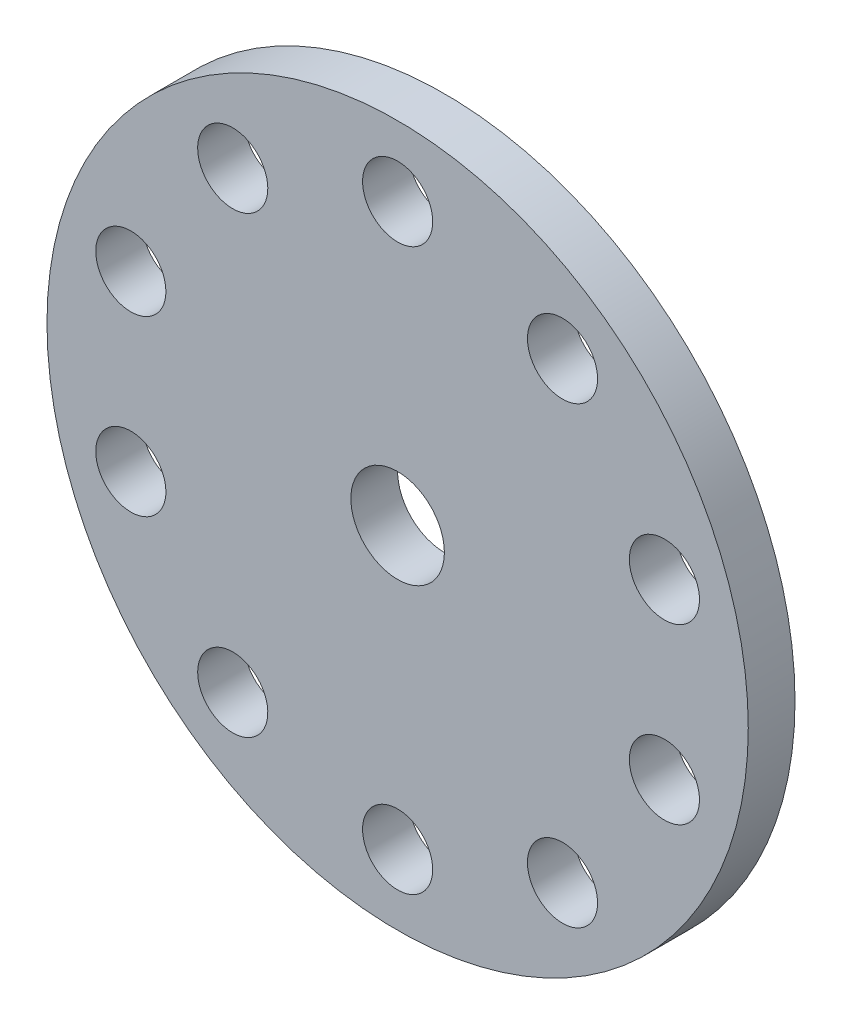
ISO-10303-21;
HEADER;
FILE_DESCRIPTION(('STEP AP214'),'2;1');
FILE_NAME('part.step','',(''),(''),'','','');
FILE_SCHEMA(('AUTOMOTIVE_DESIGN { 1 0 10303 214 1 1 1 1 }'));
ENDSEC;
DATA;
#1=APPLICATION_CONTEXT('core data for automotive mechanical design processes');
#2=APPLICATION_PROTOCOL_DEFINITION('international standard','automotive_design',2000,#1);
#3=PRODUCT_CONTEXT('',#1,'mechanical');
#4=PRODUCT('Part','Part','',(#3));
#5=PRODUCT_RELATED_PRODUCT_CATEGORY('part','',(#4));
#6=PRODUCT_DEFINITION_FORMATION('','',#4);
#7=PRODUCT_DEFINITION_CONTEXT('part definition',#1,'design');
#8=PRODUCT_DEFINITION('design','',#6,#7);
#9=PRODUCT_DEFINITION_SHAPE('','',#8);
#10=(LENGTH_UNIT() NAMED_UNIT(*) SI_UNIT(.MILLI.,.METRE.));
#11=(NAMED_UNIT(*) PLANE_ANGLE_UNIT() SI_UNIT($,.RADIAN.));
#12=(NAMED_UNIT(*) SI_UNIT($,.STERADIAN.) SOLID_ANGLE_UNIT());
#13=UNCERTAINTY_MEASURE_WITH_UNIT(LENGTH_MEASURE(1.E-05),#10,'distance_accuracy_value','');
#14=(GEOMETRIC_REPRESENTATION_CONTEXT(3) GLOBAL_UNCERTAINTY_ASSIGNED_CONTEXT((#13)) GLOBAL_UNIT_ASSIGNED_CONTEXT((#10,
#11,#12)) REPRESENTATION_CONTEXT('',''));
#15=CARTESIAN_POINT('',(0.,0.,0.));
#16=DIRECTION('',(0.,0.,1.));
#17=DIRECTION('',(1.,0.,0.));
#18=AXIS2_PLACEMENT_3D('',#15,#16,#17);
#19=CARTESIAN_POINT('',(0.,0.,20.));
#20=DIRECTION('',(0.,0.,1.));
#21=DIRECTION('',(1.,0.,0.));
#22=AXIS2_PLACEMENT_3D('',#19,#20,#21);
#23=PLANE('',#22);
#24=CARTESIAN_POINT('',(70.5342302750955,97.0820393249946,20.));
#25=DIRECTION('',(0.,0.,1.));
#26=DIRECTION('',(0.809016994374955,-0.587785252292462,0.));
#27=AXIS2_PLACEMENT_3D('',#24,#25,#26);
#28=CIRCLE('',#27,15.);
#29=CARTESIAN_POINT('',(82.6694851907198,88.2652605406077,20.));
#30=VERTEX_POINT('',#29);
#31=EDGE_CURVE('E61',#30,#30,#28,.T.);
#32=ORIENTED_EDGE('',*,*,#31,.F.);
#33=EDGE_LOOP('',(#32));
#34=FACE_BOUND('',#33,.T.);
#35=CARTESIAN_POINT('',(114.126781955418,37.082039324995,20.));
#36=DIRECTION('',(0.,0.,1.));
#37=DIRECTION('',(0.309016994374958,-0.95105651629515,0.));
#38=AXIS2_PLACEMENT_3D('',#35,#36,#37);
#39=CIRCLE('',#38,15.);
#40=CARTESIAN_POINT('',(118.762036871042,22.8161915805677,20.));
#41=VERTEX_POINT('',#40);
#42=EDGE_CURVE('E67',#41,#41,#39,.T.);
#43=ORIENTED_EDGE('',*,*,#42,.F.);
#44=EDGE_LOOP('',(#43));
#45=FACE_BOUND('',#44,.T.);
#46=CARTESIAN_POINT('',(114.126781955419,-37.0820393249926,20.));
#47=DIRECTION('',(0.,0.,1.));
#48=DIRECTION('',(-0.309016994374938,-0.951056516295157,0.));
#49=AXIS2_PLACEMENT_3D('',#46,#47,#48);
#50=CIRCLE('',#49,15.);
#51=CARTESIAN_POINT('',(109.491527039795,-51.3478870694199,20.));
#52=VERTEX_POINT('',#51);
#53=EDGE_CURVE('E73',#52,#52,#50,.T.);
#54=ORIENTED_EDGE('',*,*,#53,.F.);
#55=EDGE_LOOP('',(#54));
#56=FACE_BOUND('',#55,.T.);
#57=CARTESIAN_POINT('',(70.5342302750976,-97.0820393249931,20.));
#58=DIRECTION('',(0.,0.,1.));
#59=DIRECTION('',(-0.809016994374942,-0.58778525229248,0.));
#60=AXIS2_PLACEMENT_3D('',#57,#58,#59);
#61=CIRCLE('',#60,15.);
#62=CARTESIAN_POINT('',(58.3989753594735,-105.89881810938,20.));
#63=VERTEX_POINT('',#62);
#64=EDGE_CURVE('E79',#63,#63,#61,.T.);
#65=ORIENTED_EDGE('',*,*,#64,.F.);
#66=EDGE_LOOP('',(#65));
#67=FACE_BOUND('',#66,.T.);
#68=CARTESIAN_POINT('',(0.,-120.,20.));
#69=DIRECTION('',(0.,0.,1.));
#70=DIRECTION('',(-1.,0.,0.));
#71=AXIS2_PLACEMENT_3D('',#68,#69,#70);
#72=CIRCLE('',#71,15.);
#73=CARTESIAN_POINT('',(-15.,-120.,20.));
#74=VERTEX_POINT('',#73);
#75=EDGE_CURVE('E85',#74,#74,#72,.T.);
#76=ORIENTED_EDGE('',*,*,#75,.F.);
#77=EDGE_LOOP('',(#76));
#78=FACE_BOUND('',#77,.T.);
#79=CARTESIAN_POINT('',(-70.5342302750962,-97.0820393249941,20.));
#80=DIRECTION('',(0.,0.,1.));
#81=DIRECTION('',(-0.809016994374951,0.587785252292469,0.));
#82=AXIS2_PLACEMENT_3D('',#79,#80,#81);
#83=CIRCLE('',#82,15.);
#84=CARTESIAN_POINT('',(-82.6694851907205,-88.2652605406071,20.));
#85=VERTEX_POINT('',#84);
#86=EDGE_CURVE('E91',#85,#85,#83,.T.);
#87=ORIENTED_EDGE('',*,*,#86,.F.);
#88=EDGE_LOOP('',(#87));
#89=FACE_BOUND('',#88,.T.);
#90=CARTESIAN_POINT('',(-114.126781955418,-37.0820393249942,20.));
#91=DIRECTION('',(0.,0.,1.));
#92=DIRECTION('',(-0.309016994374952,0.951056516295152,0.));
#93=AXIS2_PLACEMENT_3D('',#90,#91,#92);
#94=CIRCLE('',#93,15.);
#95=CARTESIAN_POINT('',(-118.762036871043,-22.8161915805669,20.));
#96=VERTEX_POINT('',#95);
#97=EDGE_CURVE('E97',#96,#96,#94,.T.);
#98=ORIENTED_EDGE('',*,*,#97,.F.);
#99=EDGE_LOOP('',(#98));
#100=FACE_BOUND('',#99,.T.);
#101=CARTESIAN_POINT('',(-114.126781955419,37.0820393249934,20.));
#102=DIRECTION('',(0.,0.,1.));
#103=DIRECTION('',(0.309016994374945,0.951056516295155,0.));
#104=AXIS2_PLACEMENT_3D('',#101,#102,#103);
#105=CIRCLE('',#104,15.);
#106=CARTESIAN_POINT('',(-109.491527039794,51.3478870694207,20.));
#107=VERTEX_POINT('',#106);
#108=EDGE_CURVE('E103',#107,#107,#105,.T.);
#109=ORIENTED_EDGE('',*,*,#108,.F.);
#110=EDGE_LOOP('',(#109));
#111=FACE_BOUND('',#110,.T.);
#112=CARTESIAN_POINT('',(-70.5342302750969,97.0820393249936,20.));
#113=DIRECTION('',(0.,0.,1.));
#114=DIRECTION('',(0.809016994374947,0.587785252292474,0.));
#115=AXIS2_PLACEMENT_3D('',#112,#113,#114);
#116=CIRCLE('',#115,15.);
#117=CARTESIAN_POINT('',(-58.3989753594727,105.898818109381,20.));
#118=VERTEX_POINT('',#117);
#119=EDGE_CURVE('E55',#118,#118,#116,.T.);
#120=ORIENTED_EDGE('',*,*,#119,.F.);
#121=EDGE_LOOP('',(#120));
#122=FACE_BOUND('',#121,.T.);
#123=CARTESIAN_POINT('',(0.,120.,20.));
#124=DIRECTION('',(0.,0.,1.));
#125=DIRECTION('',(1.,0.,0.));
#126=AXIS2_PLACEMENT_3D('',#123,#124,#125);
#127=CIRCLE('',#126,15.);
#128=CARTESIAN_POINT('',(15.,120.,20.));
#129=VERTEX_POINT('',#128);
#130=EDGE_CURVE('E49',#129,#129,#127,.T.);
#131=ORIENTED_EDGE('',*,*,#130,.F.);
#132=EDGE_LOOP('',(#131));
#133=FACE_BOUND('',#132,.T.);
#134=CARTESIAN_POINT('',(0.,0.,20.));
#135=DIRECTION('',(0.,0.,1.));
#136=DIRECTION('',(1.,0.,0.));
#137=AXIS2_PLACEMENT_3D('',#134,#135,#136);
#138=CIRCLE('',#137,150.);
#139=CARTESIAN_POINT('',(150.,0.,20.));
#140=VERTEX_POINT('',#139);
#141=EDGE_CURVE('E10',#140,#140,#138,.T.);
#142=ORIENTED_EDGE('',*,*,#141,.T.);
#143=EDGE_LOOP('',(#142));
#144=FACE_BOUND('',#143,.T.);
#145=CARTESIAN_POINT('',(0.,0.,20.));
#146=DIRECTION('',(0.,0.,1.));
#147=DIRECTION('',(1.,0.,0.));
#148=AXIS2_PLACEMENT_3D('',#145,#146,#147);
#149=CIRCLE('',#148,20.);
#150=CARTESIAN_POINT('',(20.,0.,20.));
#151=VERTEX_POINT('',#150);
#152=EDGE_CURVE('E41',#151,#151,#149,.T.);
#153=ORIENTED_EDGE('',*,*,#152,.F.);
#154=EDGE_LOOP('',(#153));
#155=FACE_BOUND('',#154,.T.);
#156=ADVANCED_FACE('F30',(#34,#45,#56,#67,#78,#89,#100,#111,#122,#133,#144,#155),#23,.T.);
#157=CARTESIAN_POINT('',(0.,0.,0.));
#158=DIRECTION('',(0.,0.,1.));
#159=DIRECTION('',(1.,0.,0.));
#160=AXIS2_PLACEMENT_3D('',#157,#158,#159);
#161=PLANE('',#160);
#162=CARTESIAN_POINT('',(70.5342302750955,97.0820393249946,0.));
#163=DIRECTION('',(0.,0.,1.));
#164=DIRECTION('',(0.809016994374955,-0.587785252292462,0.));
#165=AXIS2_PLACEMENT_3D('',#162,#163,#164);
#166=CIRCLE('',#165,15.);
#167=CARTESIAN_POINT('',(82.6694851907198,88.2652605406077,0.));
#168=VERTEX_POINT('',#167);
#169=EDGE_CURVE('E64',#168,#168,#166,.T.);
#170=ORIENTED_EDGE('',*,*,#169,.T.);
#171=EDGE_LOOP('',(#170));
#172=FACE_BOUND('',#171,.T.);
#173=CARTESIAN_POINT('',(114.126781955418,37.082039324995,0.));
#174=DIRECTION('',(0.,0.,1.));
#175=DIRECTION('',(0.309016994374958,-0.95105651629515,0.));
#176=AXIS2_PLACEMENT_3D('',#173,#174,#175);
#177=CIRCLE('',#176,15.);
#178=CARTESIAN_POINT('',(118.762036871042,22.8161915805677,0.));
#179=VERTEX_POINT('',#178);
#180=EDGE_CURVE('E70',#179,#179,#177,.T.);
#181=ORIENTED_EDGE('',*,*,#180,.T.);
#182=EDGE_LOOP('',(#181));
#183=FACE_BOUND('',#182,.T.);
#184=CARTESIAN_POINT('',(114.126781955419,-37.0820393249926,0.));
#185=DIRECTION('',(0.,0.,1.));
#186=DIRECTION('',(-0.309016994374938,-0.951056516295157,0.));
#187=AXIS2_PLACEMENT_3D('',#184,#185,#186);
#188=CIRCLE('',#187,15.);
#189=CARTESIAN_POINT('',(109.491527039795,-51.3478870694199,0.));
#190=VERTEX_POINT('',#189);
#191=EDGE_CURVE('E76',#190,#190,#188,.T.);
#192=ORIENTED_EDGE('',*,*,#191,.T.);
#193=EDGE_LOOP('',(#192));
#194=FACE_BOUND('',#193,.T.);
#195=CARTESIAN_POINT('',(70.5342302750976,-97.0820393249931,0.));
#196=DIRECTION('',(0.,0.,1.));
#197=DIRECTION('',(-0.809016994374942,-0.58778525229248,0.));
#198=AXIS2_PLACEMENT_3D('',#195,#196,#197);
#199=CIRCLE('',#198,15.);
#200=CARTESIAN_POINT('',(58.3989753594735,-105.89881810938,0.));
#201=VERTEX_POINT('',#200);
#202=EDGE_CURVE('E82',#201,#201,#199,.T.);
#203=ORIENTED_EDGE('',*,*,#202,.T.);
#204=EDGE_LOOP('',(#203));
#205=FACE_BOUND('',#204,.T.);
#206=CARTESIAN_POINT('',(0.,-120.,0.));
#207=DIRECTION('',(0.,0.,1.));
#208=DIRECTION('',(-1.,0.,0.));
#209=AXIS2_PLACEMENT_3D('',#206,#207,#208);
#210=CIRCLE('',#209,15.);
#211=CARTESIAN_POINT('',(-15.,-120.,0.));
#212=VERTEX_POINT('',#211);
#213=EDGE_CURVE('E88',#212,#212,#210,.T.);
#214=ORIENTED_EDGE('',*,*,#213,.T.);
#215=EDGE_LOOP('',(#214));
#216=FACE_BOUND('',#215,.T.);
#217=CARTESIAN_POINT('',(-70.5342302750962,-97.0820393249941,0.));
#218=DIRECTION('',(0.,0.,1.));
#219=DIRECTION('',(-0.809016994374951,0.587785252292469,0.));
#220=AXIS2_PLACEMENT_3D('',#217,#218,#219);
#221=CIRCLE('',#220,15.);
#222=CARTESIAN_POINT('',(-82.6694851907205,-88.2652605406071,0.));
#223=VERTEX_POINT('',#222);
#224=EDGE_CURVE('E94',#223,#223,#221,.T.);
#225=ORIENTED_EDGE('',*,*,#224,.T.);
#226=EDGE_LOOP('',(#225));
#227=FACE_BOUND('',#226,.T.);
#228=CARTESIAN_POINT('',(-114.126781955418,-37.0820393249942,0.));
#229=DIRECTION('',(0.,0.,1.));
#230=DIRECTION('',(-0.309016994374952,0.951056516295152,0.));
#231=AXIS2_PLACEMENT_3D('',#228,#229,#230);
#232=CIRCLE('',#231,15.);
#233=CARTESIAN_POINT('',(-118.762036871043,-22.8161915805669,0.));
#234=VERTEX_POINT('',#233);
#235=EDGE_CURVE('E100',#234,#234,#232,.T.);
#236=ORIENTED_EDGE('',*,*,#235,.T.);
#237=EDGE_LOOP('',(#236));
#238=FACE_BOUND('',#237,.T.);
#239=CARTESIAN_POINT('',(-114.126781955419,37.0820393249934,0.));
#240=DIRECTION('',(0.,0.,1.));
#241=DIRECTION('',(0.309016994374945,0.951056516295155,0.));
#242=AXIS2_PLACEMENT_3D('',#239,#240,#241);
#243=CIRCLE('',#242,15.);
#244=CARTESIAN_POINT('',(-109.491527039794,51.3478870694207,0.));
#245=VERTEX_POINT('',#244);
#246=EDGE_CURVE('E58',#245,#245,#243,.T.);
#247=ORIENTED_EDGE('',*,*,#246,.T.);
#248=EDGE_LOOP('',(#247));
#249=FACE_BOUND('',#248,.T.);
#250=CARTESIAN_POINT('',(-70.5342302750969,97.0820393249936,0.));
#251=DIRECTION('',(0.,0.,1.));
#252=DIRECTION('',(0.809016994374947,0.587785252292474,0.));
#253=AXIS2_PLACEMENT_3D('',#250,#251,#252);
#254=CIRCLE('',#253,15.);
#255=CARTESIAN_POINT('',(-58.3989753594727,105.898818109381,0.));
#256=VERTEX_POINT('',#255);
#257=EDGE_CURVE('E52',#256,#256,#254,.T.);
#258=ORIENTED_EDGE('',*,*,#257,.T.);
#259=EDGE_LOOP('',(#258));
#260=FACE_BOUND('',#259,.T.);
#261=CARTESIAN_POINT('',(0.,120.,0.));
#262=DIRECTION('',(0.,0.,1.));
#263=DIRECTION('',(1.,0.,0.));
#264=AXIS2_PLACEMENT_3D('',#261,#262,#263);
#265=CIRCLE('',#264,15.);
#266=CARTESIAN_POINT('',(15.,120.,0.));
#267=VERTEX_POINT('',#266);
#268=EDGE_CURVE('E46',#267,#267,#265,.T.);
#269=ORIENTED_EDGE('',*,*,#268,.T.);
#270=EDGE_LOOP('',(#269));
#271=FACE_BOUND('',#270,.T.);
#272=CARTESIAN_POINT('',(0.,0.,0.));
#273=DIRECTION('',(0.,0.,1.));
#274=DIRECTION('',(1.,0.,0.));
#275=AXIS2_PLACEMENT_3D('',#272,#273,#274);
#276=CIRCLE('',#275,150.);
#277=CARTESIAN_POINT('',(150.,0.,0.));
#278=VERTEX_POINT('',#277);
#279=EDGE_CURVE('E34',#278,#278,#276,.T.);
#280=ORIENTED_EDGE('',*,*,#279,.F.);
#281=EDGE_LOOP('',(#280));
#282=FACE_BOUND('',#281,.T.);
#283=CARTESIAN_POINT('',(0.,0.,0.));
#284=DIRECTION('',(0.,0.,1.));
#285=DIRECTION('',(1.,0.,0.));
#286=AXIS2_PLACEMENT_3D('',#283,#284,#285);
#287=CIRCLE('',#286,20.);
#288=CARTESIAN_POINT('',(20.,0.,0.));
#289=VERTEX_POINT('',#288);
#290=EDGE_CURVE('E43',#289,#289,#287,.T.);
#291=ORIENTED_EDGE('',*,*,#290,.T.);
#292=EDGE_LOOP('',(#291));
#293=FACE_BOUND('',#292,.T.);
#294=ADVANCED_FACE('F109',(#172,#183,#194,#205,#216,#227,#238,#249,#260,#271,#282,#293),#161,.F.);
#295=CARTESIAN_POINT('',(0.,0.,20.));
#296=DIRECTION('',(0.,0.,-1.));
#297=DIRECTION('',(-1.,0.,0.));
#298=AXIS2_PLACEMENT_3D('',#295,#296,#297);
#299=CYLINDRICAL_SURFACE('',#298,150.);
#300=ORIENTED_EDGE('',*,*,#141,.F.);
#301=EDGE_LOOP('',(#300));
#302=FACE_BOUND('',#301,.T.);
#303=ORIENTED_EDGE('',*,*,#279,.T.);
#304=EDGE_LOOP('',(#303));
#305=FACE_BOUND('',#304,.T.);
#306=ADVANCED_FACE('F32',(#302,#305),#299,.T.);
#307=CARTESIAN_POINT('',(0.,0.,20.));
#308=DIRECTION('',(0.,0.,-1.));
#309=DIRECTION('',(-1.,0.,0.));
#310=AXIS2_PLACEMENT_3D('',#307,#308,#309);
#311=CYLINDRICAL_SURFACE('',#310,20.);
#312=ORIENTED_EDGE('',*,*,#152,.T.);
#313=EDGE_LOOP('',(#312));
#314=FACE_BOUND('',#313,.T.);
#315=ORIENTED_EDGE('',*,*,#290,.F.);
#316=EDGE_LOOP('',(#315));
#317=FACE_BOUND('',#316,.T.);
#318=ADVANCED_FACE('F130',(#314,#317),#311,.F.);
#319=CARTESIAN_POINT('',(0.,120.,0.));
#320=DIRECTION('',(0.,0.,1.));
#321=DIRECTION('',(1.,0.,0.));
#322=AXIS2_PLACEMENT_3D('',#319,#320,#321);
#323=CYLINDRICAL_SURFACE('',#322,15.);
#324=ORIENTED_EDGE('',*,*,#268,.F.);
#325=EDGE_LOOP('',(#324));
#326=FACE_BOUND('',#325,.T.);
#327=ORIENTED_EDGE('',*,*,#130,.T.);
#328=EDGE_LOOP('',(#327));
#329=FACE_BOUND('',#328,.T.);
#330=ADVANCED_FACE('F133',(#326,#329),#323,.F.);
#331=CARTESIAN_POINT('',(-70.5342302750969,97.0820393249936,0.));
#332=DIRECTION('',(0.,0.,1.));
#333=DIRECTION('',(1.,0.,0.));
#334=AXIS2_PLACEMENT_3D('',#331,#332,#333);
#335=CYLINDRICAL_SURFACE('',#334,15.);
#336=ORIENTED_EDGE('',*,*,#257,.F.);
#337=EDGE_LOOP('',(#336));
#338=FACE_BOUND('',#337,.T.);
#339=ORIENTED_EDGE('',*,*,#119,.T.);
#340=EDGE_LOOP('',(#339));
#341=FACE_BOUND('',#340,.T.);
#342=ADVANCED_FACE('F116',(#338,#341),#335,.F.);
#343=CARTESIAN_POINT('',(-114.126781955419,37.0820393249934,0.));
#344=DIRECTION('',(0.,0.,1.));
#345=DIRECTION('',(1.,0.,0.));
#346=AXIS2_PLACEMENT_3D('',#343,#344,#345);
#347=CYLINDRICAL_SURFACE('',#346,15.);
#348=ORIENTED_EDGE('',*,*,#246,.F.);
#349=EDGE_LOOP('',(#348));
#350=FACE_BOUND('',#349,.T.);
#351=ORIENTED_EDGE('',*,*,#108,.T.);
#352=EDGE_LOOP('',(#351));
#353=FACE_BOUND('',#352,.T.);
#354=ADVANCED_FACE('F112',(#350,#353),#347,.F.);
#355=CARTESIAN_POINT('',(-114.126781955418,-37.0820393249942,0.));
#356=DIRECTION('',(0.,0.,1.));
#357=DIRECTION('',(1.,0.,0.));
#358=AXIS2_PLACEMENT_3D('',#355,#356,#357);
#359=CYLINDRICAL_SURFACE('',#358,15.);
#360=ORIENTED_EDGE('',*,*,#235,.F.);
#361=EDGE_LOOP('',(#360));
#362=FACE_BOUND('',#361,.T.);
#363=ORIENTED_EDGE('',*,*,#97,.T.);
#364=EDGE_LOOP('',(#363));
#365=FACE_BOUND('',#364,.T.);
#366=ADVANCED_FACE('F115',(#362,#365),#359,.F.);
#367=CARTESIAN_POINT('',(-70.5342302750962,-97.0820393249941,0.));
#368=DIRECTION('',(0.,0.,1.));
#369=DIRECTION('',(1.,0.,0.));
#370=AXIS2_PLACEMENT_3D('',#367,#368,#369);
#371=CYLINDRICAL_SURFACE('',#370,15.);
#372=ORIENTED_EDGE('',*,*,#224,.F.);
#373=EDGE_LOOP('',(#372));
#374=FACE_BOUND('',#373,.T.);
#375=ORIENTED_EDGE('',*,*,#86,.T.);
#376=EDGE_LOOP('',(#375));
#377=FACE_BOUND('',#376,.T.);
#378=ADVANCED_FACE('F170',(#374,#377),#371,.F.);
#379=CARTESIAN_POINT('',(0.,-120.,0.));
#380=DIRECTION('',(0.,0.,1.));
#381=DIRECTION('',(1.,0.,0.));
#382=AXIS2_PLACEMENT_3D('',#379,#380,#381);
#383=CYLINDRICAL_SURFACE('',#382,15.);
#384=ORIENTED_EDGE('',*,*,#213,.F.);
#385=EDGE_LOOP('',(#384));
#386=FACE_BOUND('',#385,.T.);
#387=ORIENTED_EDGE('',*,*,#75,.T.);
#388=EDGE_LOOP('',(#387));
#389=FACE_BOUND('',#388,.T.);
#390=ADVANCED_FACE('F166',(#386,#389),#383,.F.);
#391=CARTESIAN_POINT('',(70.5342302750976,-97.0820393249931,0.));
#392=DIRECTION('',(0.,0.,1.));
#393=DIRECTION('',(1.,0.,0.));
#394=AXIS2_PLACEMENT_3D('',#391,#392,#393);
#395=CYLINDRICAL_SURFACE('',#394,15.);
#396=ORIENTED_EDGE('',*,*,#202,.F.);
#397=EDGE_LOOP('',(#396));
#398=FACE_BOUND('',#397,.T.);
#399=ORIENTED_EDGE('',*,*,#64,.T.);
#400=EDGE_LOOP('',(#399));
#401=FACE_BOUND('',#400,.T.);
#402=ADVANCED_FACE('F162',(#398,#401),#395,.F.);
#403=CARTESIAN_POINT('',(114.126781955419,-37.0820393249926,0.));
#404=DIRECTION('',(0.,0.,1.));
#405=DIRECTION('',(1.,0.,0.));
#406=AXIS2_PLACEMENT_3D('',#403,#404,#405);
#407=CYLINDRICAL_SURFACE('',#406,15.);
#408=ORIENTED_EDGE('',*,*,#191,.F.);
#409=EDGE_LOOP('',(#408));
#410=FACE_BOUND('',#409,.T.);
#411=ORIENTED_EDGE('',*,*,#53,.T.);
#412=EDGE_LOOP('',(#411));
#413=FACE_BOUND('',#412,.T.);
#414=ADVANCED_FACE('F158',(#410,#413),#407,.F.);
#415=CARTESIAN_POINT('',(114.126781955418,37.082039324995,0.));
#416=DIRECTION('',(0.,0.,1.));
#417=DIRECTION('',(1.,0.,0.));
#418=AXIS2_PLACEMENT_3D('',#415,#416,#417);
#419=CYLINDRICAL_SURFACE('',#418,15.);
#420=ORIENTED_EDGE('',*,*,#180,.F.);
#421=EDGE_LOOP('',(#420));
#422=FACE_BOUND('',#421,.T.);
#423=ORIENTED_EDGE('',*,*,#42,.T.);
#424=EDGE_LOOP('',(#423));
#425=FACE_BOUND('',#424,.T.);
#426=ADVANCED_FACE('F154',(#422,#425),#419,.F.);
#427=CARTESIAN_POINT('',(70.5342302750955,97.0820393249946,0.));
#428=DIRECTION('',(0.,0.,1.));
#429=DIRECTION('',(1.,0.,0.));
#430=AXIS2_PLACEMENT_3D('',#427,#428,#429);
#431=CYLINDRICAL_SURFACE('',#430,15.);
#432=ORIENTED_EDGE('',*,*,#169,.F.);
#433=EDGE_LOOP('',(#432));
#434=FACE_BOUND('',#433,.T.);
#435=ORIENTED_EDGE('',*,*,#31,.T.);
#436=EDGE_LOOP('',(#435));
#437=FACE_BOUND('',#436,.T.);
#438=ADVANCED_FACE('F151',(#434,#437),#431,.F.);
#439=CLOSED_SHELL('',(#156,#294,#306,#318,#330,#342,#354,#366,#378,#390,#402,#414,#426,#438));
#440=MANIFOLD_SOLID_BREP('B2',#439);
#441=ADVANCED_BREP_SHAPE_REPRESENTATION('',(#18,#440),#14);
#442=SHAPE_DEFINITION_REPRESENTATION(#9,#441);
ENDSEC;
END-ISO-10303-21;
